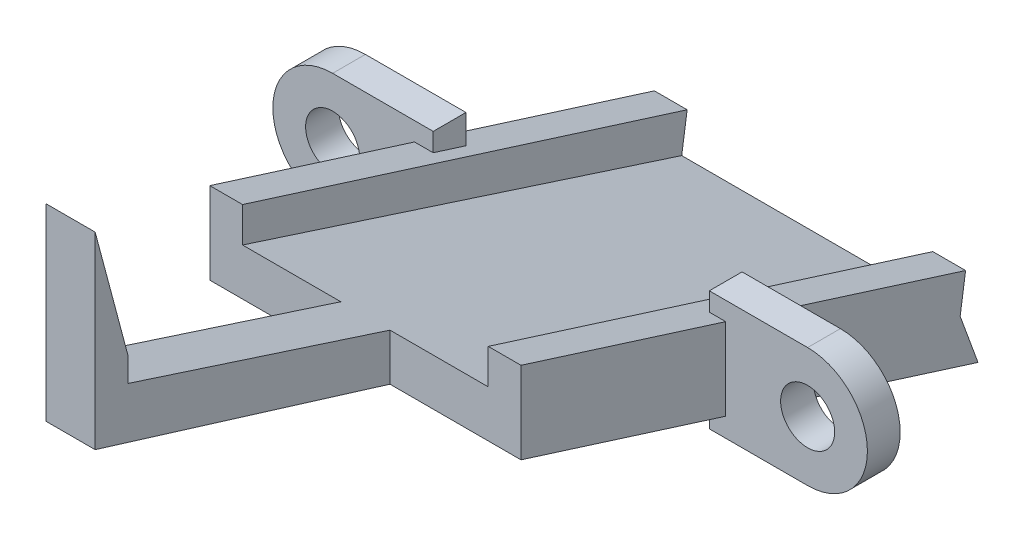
ISO-10303-21;
HEADER;
FILE_DESCRIPTION(('STEP AP214'),'2;1');
FILE_NAME('part.step','',(''),(''),'','','');
FILE_SCHEMA(('AUTOMOTIVE_DESIGN { 1 0 10303 214 1 1 1 1 }'));
ENDSEC;
DATA;
#1=APPLICATION_CONTEXT('core data for automotive mechanical design processes');
#2=APPLICATION_PROTOCOL_DEFINITION('international standard','automotive_design',2000,#1);
#3=PRODUCT_CONTEXT('',#1,'mechanical');
#4=PRODUCT('Part','Part','',(#3));
#5=PRODUCT_RELATED_PRODUCT_CATEGORY('part','',(#4));
#6=PRODUCT_DEFINITION_FORMATION('','',#4);
#7=PRODUCT_DEFINITION_CONTEXT('part definition',#1,'design');
#8=PRODUCT_DEFINITION('design','',#6,#7);
#9=PRODUCT_DEFINITION_SHAPE('','',#8);
#10=(LENGTH_UNIT() NAMED_UNIT(*) SI_UNIT(.MILLI.,.METRE.));
#11=(NAMED_UNIT(*) PLANE_ANGLE_UNIT() SI_UNIT($,.RADIAN.));
#12=(NAMED_UNIT(*) SI_UNIT($,.STERADIAN.) SOLID_ANGLE_UNIT());
#13=UNCERTAINTY_MEASURE_WITH_UNIT(LENGTH_MEASURE(1.E-05),#10,'distance_accuracy_value','');
#14=(GEOMETRIC_REPRESENTATION_CONTEXT(3) GLOBAL_UNCERTAINTY_ASSIGNED_CONTEXT((#13)) GLOBAL_UNIT_ASSIGNED_CONTEXT((#10,
#11,#12)) REPRESENTATION_CONTEXT('',''));
#15=CARTESIAN_POINT('',(0.,0.,0.));
#16=DIRECTION('',(0.,0.,1.));
#17=DIRECTION('',(1.,0.,0.));
#18=AXIS2_PLACEMENT_3D('',#15,#16,#17);
#19=CARTESIAN_POINT('',(9.5,-5.53846153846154,-18.));
#20=DIRECTION('',(0.,0.953696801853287,-0.300769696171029));
#21=DIRECTION('',(0.,0.300769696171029,0.953696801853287));
#22=AXIS2_PLACEMENT_3D('',#19,#20,#21);
#23=PLANE('',#22);
#24=DIRECTION('',(0.,-0.300769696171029,-0.953696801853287));
#25=VECTOR('',#24,1.);
#26=CARTESIAN_POINT('',(-9.5,-5.53846153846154,-18.));
#27=LINE('',#26,#25);
#28=CARTESIAN_POINT('',(-9.5,-5.53846153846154,-18.));
#29=VERTEX_POINT('',#28);
#30=CARTESIAN_POINT('',(-9.5,-9.48061715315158,-30.5));
#31=VERTEX_POINT('',#30);
#32=EDGE_CURVE('E453',#29,#31,#27,.T.);
#33=ORIENTED_EDGE('',*,*,#32,.T.);
#34=DIRECTION('',(1.,0.,0.));
#35=VECTOR('',#34,1.);
#36=CARTESIAN_POINT('',(9.5,-9.48061715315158,-30.5));
#37=LINE('',#36,#35);
#38=CARTESIAN_POINT('',(-8.36014397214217,-9.48061715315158,-30.5));
#39=VERTEX_POINT('',#38);
#40=EDGE_CURVE('E61',#31,#39,#37,.T.);
#41=ORIENTED_EDGE('',*,*,#40,.T.);
#42=DIRECTION('',(0.,0.300769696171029,0.953696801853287));
#43=VECTOR('',#42,1.);
#44=CARTESIAN_POINT('',(-8.36014397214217,-5.53846153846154,-18.));
#45=LINE('',#44,#43);
#46=CARTESIAN_POINT('',(-8.36014397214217,-10.111362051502,-32.5));
#47=VERTEX_POINT('',#46);
#48=EDGE_CURVE('E65',#47,#39,#45,.T.);
#49=ORIENTED_EDGE('',*,*,#48,.F.);
#50=DIRECTION('',(1.,0.,0.));
#51=VECTOR('',#50,1.);
#52=CARTESIAN_POINT('',(9.5,-10.111362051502,-32.5));
#53=LINE('',#52,#51);
#54=CARTESIAN_POINT('',(-9.5,-10.111362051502,-32.5));
#55=VERTEX_POINT('',#54);
#56=EDGE_CURVE('E344',#55,#47,#53,.T.);
#57=ORIENTED_EDGE('',*,*,#56,.F.);
#58=CARTESIAN_POINT('',(-9.5,-14.3379199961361,-45.9017982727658));
#59=VERTEX_POINT('',#58);
#60=EDGE_CURVE('E452',#55,#59,#27,.T.);
#61=ORIENTED_EDGE('',*,*,#60,.T.);
#62=DIRECTION('',(-1.,0.,0.));
#63=VECTOR('',#62,1.);
#64=CARTESIAN_POINT('',(1.5,-14.3379199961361,-45.9017982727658));
#65=LINE('',#64,#63);
#66=CARTESIAN_POINT('',(9.5,-14.3379199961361,-45.9017982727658));
#67=VERTEX_POINT('',#66);
#68=EDGE_CURVE('E525',#67,#59,#65,.T.);
#69=ORIENTED_EDGE('',*,*,#68,.F.);
#70=DIRECTION('',(0.,-0.300769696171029,-0.953696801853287));
#71=VECTOR('',#70,1.);
#72=CARTESIAN_POINT('',(9.5,-5.53846153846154,-18.));
#73=LINE('',#72,#71);
#74=CARTESIAN_POINT('',(9.5,-10.111362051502,-32.5));
#75=VERTEX_POINT('',#74);
#76=EDGE_CURVE('E438',#75,#67,#73,.T.);
#77=ORIENTED_EDGE('',*,*,#76,.F.);
#78=DIRECTION('',(-1.,0.,0.));
#79=VECTOR('',#78,1.);
#80=CARTESIAN_POINT('',(9.5,-10.111362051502,-32.5));
#81=LINE('',#80,#79);
#82=CARTESIAN_POINT('',(8.49870989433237,-10.111362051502,-32.5));
#83=VERTEX_POINT('',#82);
#84=EDGE_CURVE('E360',#75,#83,#81,.T.);
#85=ORIENTED_EDGE('',*,*,#84,.T.);
#86=DIRECTION('',(0.,-0.300769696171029,-0.953696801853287));
#87=VECTOR('',#86,1.);
#88=CARTESIAN_POINT('',(8.49870989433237,-5.53846153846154,-18.));
#89=LINE('',#88,#87);
#90=CARTESIAN_POINT('',(8.49870989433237,-9.48061715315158,-30.5));
#91=VERTEX_POINT('',#90);
#92=EDGE_CURVE('E352',#91,#83,#89,.T.);
#93=ORIENTED_EDGE('',*,*,#92,.F.);
#94=DIRECTION('',(-1.,0.,0.));
#95=VECTOR('',#94,1.);
#96=CARTESIAN_POINT('',(9.5,-9.48061715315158,-30.5));
#97=LINE('',#96,#95);
#98=CARTESIAN_POINT('',(9.5,-9.48061715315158,-30.5));
#99=VERTEX_POINT('',#98);
#100=EDGE_CURVE('E366',#99,#91,#97,.T.);
#101=ORIENTED_EDGE('',*,*,#100,.F.);
#102=CARTESIAN_POINT('',(9.5,-5.53846153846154,-18.));
#103=VERTEX_POINT('',#102);
#104=EDGE_CURVE('E440',#103,#99,#73,.T.);
#105=ORIENTED_EDGE('',*,*,#104,.F.);
#106=DIRECTION('',(-1.,0.,0.));
#107=VECTOR('',#106,1.);
#108=CARTESIAN_POINT('',(9.5,-5.53846153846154,-18.));
#109=LINE('',#108,#107);
#110=CARTESIAN_POINT('',(1.5,-5.53846153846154,-18.));
#111=VERTEX_POINT('',#110);
#112=EDGE_CURVE('E458',#103,#111,#109,.T.);
#113=ORIENTED_EDGE('',*,*,#112,.T.);
#114=CARTESIAN_POINT('',(-1.5,-5.53846153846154,-18.));
#115=VERTEX_POINT('',#114);
#116=EDGE_CURVE('E462',#111,#115,#109,.T.);
#117=ORIENTED_EDGE('',*,*,#116,.T.);
#118=EDGE_CURVE('E448',#115,#29,#109,.T.);
#119=ORIENTED_EDGE('',*,*,#118,.T.);
#120=EDGE_LOOP('',(#33,#41,#49,#57,#61,#69,#77,#85,#93,#101,#105,#113,#117,#119));
#121=FACE_BOUND('',#120,.T.);
#122=ADVANCED_FACE('F45',(#121),#23,.F.);
#123=CARTESIAN_POINT('',(9.5,0.,0.));
#124=DIRECTION('',(1.,0.,0.));
#125=DIRECTION('',(0.,0.,-1.));
#126=AXIS2_PLACEMENT_3D('',#123,#124,#125);
#127=PLANE('',#126);
#128=ORIENTED_EDGE('',*,*,#104,.T.);
#129=DIRECTION('',(0.,1.,0.));
#130=VECTOR('',#129,1.);
#131=CARTESIAN_POINT('',(9.5,0.,-30.5));
#132=LINE('',#131,#130);
#133=CARTESIAN_POINT('',(9.5,-4.48061715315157,-30.5));
#134=VERTEX_POINT('',#133);
#135=EDGE_CURVE('E363',#99,#134,#132,.T.);
#136=ORIENTED_EDGE('',*,*,#135,.T.);
#137=DIRECTION('',(0.,-0.300769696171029,-0.953696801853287));
#138=VECTOR('',#137,1.);
#139=CARTESIAN_POINT('',(9.5,4.67342474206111,-1.4738694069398));
#140=LINE('',#139,#138);
#141=CARTESIAN_POINT('',(9.5,-0.538461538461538,-18.));
#142=VERTEX_POINT('',#141);
#143=EDGE_CURVE('E417',#142,#134,#140,.T.);
#144=ORIENTED_EDGE('',*,*,#143,.F.);
#145=DIRECTION('',(0.,-1.,0.));
#146=VECTOR('',#145,1.);
#147=CARTESIAN_POINT('',(9.5,-2.67891095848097,-18.));
#148=LINE('',#147,#146);
#149=EDGE_CURVE('E435',#142,#103,#148,.T.);
#150=ORIENTED_EDGE('',*,*,#149,.T.);
#151=EDGE_LOOP('',(#128,#136,#144,#150));
#152=FACE_BOUND('',#151,.T.);
#153=ADVANCED_FACE('F670',(#152),#127,.T.);
#154=CARTESIAN_POINT('',(-9.5,0.,0.));
#155=DIRECTION('',(1.,0.,0.));
#156=DIRECTION('',(0.,0.,-1.));
#157=AXIS2_PLACEMENT_3D('',#154,#155,#156);
#158=PLANE('',#157);
#159=DIRECTION('',(0.,-1.,0.));
#160=VECTOR('',#159,1.);
#161=CARTESIAN_POINT('',(-9.5,0.,-32.5));
#162=LINE('',#161,#160);
#163=CARTESIAN_POINT('',(-9.5,-5.11136205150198,-32.5));
#164=VERTEX_POINT('',#163);
#165=EDGE_CURVE('E280',#164,#55,#162,.T.);
#166=ORIENTED_EDGE('',*,*,#165,.F.);
#167=DIRECTION('',(0.,0.300769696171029,0.953696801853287));
#168=VECTOR('',#167,1.);
#169=CARTESIAN_POINT('',(-9.5,4.67342474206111,-1.4738694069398));
#170=LINE('',#169,#168);
#171=CARTESIAN_POINT('',(-9.5,-9.09931594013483,-45.1452196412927));
#172=VERTEX_POINT('',#171);
#173=EDGE_CURVE('E384',#172,#164,#170,.T.);
#174=ORIENTED_EDGE('',*,*,#173,.F.);
#175=DIRECTION('',(0.,0.989359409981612,-0.145492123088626));
#176=VECTOR('',#175,1.);
#177=CARTESIAN_POINT('',(-9.5,-6.69099748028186,-45.4993794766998));
#178=LINE('',#177,#176);
#179=CARTESIAN_POINT('',(-9.5,-11.3578239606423,-44.8130904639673));
#180=VERTEX_POINT('',#179);
#181=EDGE_CURVE('E376',#180,#172,#178,.T.);
#182=ORIENTED_EDGE('',*,*,#181,.F.);
#183=DIRECTION('',(0.,0.939282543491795,0.343144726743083));
#184=VECTOR('',#183,1.);
#185=CARTESIAN_POINT('',(-9.5,-14.3379199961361,-45.9017982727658));
#186=LINE('',#185,#184);
#187=EDGE_CURVE('E439',#59,#180,#186,.T.);
#188=ORIENTED_EDGE('',*,*,#187,.F.);
#189=ORIENTED_EDGE('',*,*,#60,.F.);
#190=EDGE_LOOP('',(#166,#174,#182,#188,#189));
#191=FACE_BOUND('',#190,.T.);
#192=ADVANCED_FACE('F656',(#191),#158,.F.);
#193=CARTESIAN_POINT('',(7.5,4.67342474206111,-1.4738694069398));
#194=DIRECTION('',(0.,-0.953696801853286,0.300769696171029));
#195=DIRECTION('',(0.,-0.300769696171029,-0.953696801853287));
#196=AXIS2_PLACEMENT_3D('',#193,#194,#195);
#197=PLANE('',#196);
#198=DIRECTION('',(1.,0.,0.));
#199=VECTOR('',#198,1.);
#200=CARTESIAN_POINT('',(7.5,-4.48061715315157,-30.5));
#201=LINE('',#200,#199);
#202=CARTESIAN_POINT('',(8.49870989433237,-4.48061715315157,-30.5));
#203=VERTEX_POINT('',#202);
#204=EDGE_CURVE('E11',#203,#134,#201,.T.);
#205=ORIENTED_EDGE('',*,*,#204,.F.);
#206=DIRECTION('',(0.,0.300769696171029,0.953696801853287));
#207=VECTOR('',#206,1.);
#208=CARTESIAN_POINT('',(8.49870989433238,4.67342474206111,-1.4738694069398));
#209=LINE('',#208,#207);
#210=CARTESIAN_POINT('',(8.49870989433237,-5.11136205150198,-32.5));
#211=VERTEX_POINT('',#210);
#212=EDGE_CURVE('E544',#211,#203,#209,.T.);
#213=ORIENTED_EDGE('',*,*,#212,.F.);
#214=DIRECTION('',(1.,0.,0.));
#215=VECTOR('',#214,1.);
#216=CARTESIAN_POINT('',(7.5,-5.11136205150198,-32.5));
#217=LINE('',#216,#215);
#218=CARTESIAN_POINT('',(9.5,-5.11136205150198,-32.5));
#219=VERTEX_POINT('',#218);
#220=EDGE_CURVE('E54',#211,#219,#217,.T.);
#221=ORIENTED_EDGE('',*,*,#220,.T.);
#222=CARTESIAN_POINT('',(9.5,-9.09931594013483,-45.1452196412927));
#223=VERTEX_POINT('',#222);
#224=EDGE_CURVE('E405',#219,#223,#140,.T.);
#225=ORIENTED_EDGE('',*,*,#224,.T.);
#226=DIRECTION('',(1.,0.,0.));
#227=VECTOR('',#226,1.);
#228=CARTESIAN_POINT('',(7.5,-9.09931594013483,-45.1452196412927));
#229=LINE('',#228,#227);
#230=CARTESIAN_POINT('',(7.5,-9.09931594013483,-45.1452196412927));
#231=VERTEX_POINT('',#230);
#232=EDGE_CURVE('E416',#231,#223,#229,.T.);
#233=ORIENTED_EDGE('',*,*,#232,.F.);
#234=DIRECTION('',(0.,-0.300769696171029,-0.953696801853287));
#235=VECTOR('',#234,1.);
#236=CARTESIAN_POINT('',(7.5,4.67342474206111,-1.4738694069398));
#237=LINE('',#236,#235);
#238=CARTESIAN_POINT('',(7.5,-0.538461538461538,-18.));
#239=VERTEX_POINT('',#238);
#240=EDGE_CURVE('E409',#239,#231,#237,.T.);
#241=ORIENTED_EDGE('',*,*,#240,.F.);
#242=DIRECTION('',(1.,0.,0.));
#243=VECTOR('',#242,1.);
#244=CARTESIAN_POINT('',(7.5,-0.538461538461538,-18.));
#245=LINE('',#244,#243);
#246=EDGE_CURVE('E426',#239,#142,#245,.T.);
#247=ORIENTED_EDGE('',*,*,#246,.T.);
#248=ORIENTED_EDGE('',*,*,#143,.T.);
#249=EDGE_LOOP('',(#205,#213,#221,#225,#233,#241,#247,#248));
#250=FACE_BOUND('',#249,.T.);
#251=ADVANCED_FACE('F551',(#250),#197,.F.);
#252=CARTESIAN_POINT('',(1.5,2.5,-2.));
#253=DIRECTION('',(0.,-0.951402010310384,0.30795164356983));
#254=DIRECTION('',(0.,-0.30795164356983,-0.951402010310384));
#255=AXIS2_PLACEMENT_3D('',#252,#253,#254);
#256=PLANE('',#255);
#257=DIRECTION('',(0.,-0.30795164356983,-0.951402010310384));
#258=VECTOR('',#257,1.);
#259=CARTESIAN_POINT('',(-7.5,2.5,-2.));
#260=LINE('',#259,#258);
#261=CARTESIAN_POINT('',(-7.5,-2.67891095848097,-18.));
#262=VERTEX_POINT('',#261);
#263=CARTESIAN_POINT('',(-7.5,-11.3578239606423,-44.8130904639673));
#264=VERTEX_POINT('',#263);
#265=EDGE_CURVE('E401',#262,#264,#260,.T.);
#266=ORIENTED_EDGE('',*,*,#265,.F.);
#267=DIRECTION('',(-1.,0.,0.));
#268=VECTOR('',#267,1.);
#269=CARTESIAN_POINT('',(9.5,-2.67891095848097,-18.));
#270=LINE('',#269,#268);
#271=CARTESIAN_POINT('',(-1.5,-2.67891095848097,-18.));
#272=VERTEX_POINT('',#271);
#273=EDGE_CURVE('E461',#272,#262,#270,.T.);
#274=ORIENTED_EDGE('',*,*,#273,.F.);
#275=DIRECTION('',(0.,0.30795164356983,0.951402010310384));
#276=VECTOR('',#275,1.);
#277=CARTESIAN_POINT('',(-1.5,2.5,-2.));
#278=LINE('',#277,#276);
#279=CARTESIAN_POINT('',(-1.5,2.5,-2.));
#280=VERTEX_POINT('',#279);
#281=EDGE_CURVE('E492',#272,#280,#278,.T.);
#282=ORIENTED_EDGE('',*,*,#281,.T.);
#283=DIRECTION('',(-1.,0.,0.));
#284=VECTOR('',#283,1.);
#285=CARTESIAN_POINT('',(1.5,2.5,-2.));
#286=LINE('',#285,#284);
#287=CARTESIAN_POINT('',(1.5,2.5,-2.));
#288=VERTEX_POINT('',#287);
#289=EDGE_CURVE('E516',#288,#280,#286,.T.);
#290=ORIENTED_EDGE('',*,*,#289,.F.);
#291=DIRECTION('',(0.,0.30795164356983,0.951402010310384));
#292=VECTOR('',#291,1.);
#293=CARTESIAN_POINT('',(1.5,2.5,-2.));
#294=LINE('',#293,#292);
#295=CARTESIAN_POINT('',(1.5,-2.67891095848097,-18.));
#296=VERTEX_POINT('',#295);
#297=EDGE_CURVE('E475',#296,#288,#294,.T.);
#298=ORIENTED_EDGE('',*,*,#297,.F.);
#299=CARTESIAN_POINT('',(7.5,-2.67891095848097,-18.));
#300=VERTEX_POINT('',#299);
#301=EDGE_CURVE('E463',#300,#296,#270,.T.);
#302=ORIENTED_EDGE('',*,*,#301,.F.);
#303=DIRECTION('',(0.,-0.30795164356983,-0.951402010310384));
#304=VECTOR('',#303,1.);
#305=CARTESIAN_POINT('',(7.5,2.5,-2.));
#306=LINE('',#305,#304);
#307=CARTESIAN_POINT('',(7.5,-11.3578239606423,-44.8130904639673));
#308=VERTEX_POINT('',#307);
#309=EDGE_CURVE('E430',#300,#308,#306,.T.);
#310=ORIENTED_EDGE('',*,*,#309,.T.);
#311=DIRECTION('',(-1.,0.,0.));
#312=VECTOR('',#311,1.);
#313=CARTESIAN_POINT('',(1.5,-11.3578239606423,-44.8130904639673));
#314=LINE('',#313,#312);
#315=EDGE_CURVE('E520',#308,#264,#314,.T.);
#316=ORIENTED_EDGE('',*,*,#315,.T.);
#317=EDGE_LOOP('',(#266,#274,#282,#290,#298,#302,#310,#316));
#318=FACE_BOUND('',#317,.T.);
#319=ADVANCED_FACE('F642',(#318),#256,.F.);
#320=CARTESIAN_POINT('',(1.5,0.,0.));
#321=DIRECTION('',(0.,0.95577900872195,-0.294085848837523));
#322=DIRECTION('',(0.,0.294085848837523,0.95577900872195));
#323=AXIS2_PLACEMENT_3D('',#320,#321,#322);
#324=PLANE('',#323);
#325=ORIENTED_EDGE('',*,*,#116,.F.);
#326=DIRECTION('',(0.,-0.294085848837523,-0.95577900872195));
#327=VECTOR('',#326,1.);
#328=CARTESIAN_POINT('',(1.5,0.,0.));
#329=LINE('',#328,#327);
#330=CARTESIAN_POINT('',(1.5,0.,0.));
#331=VERTEX_POINT('',#330);
#332=EDGE_CURVE('E471',#331,#111,#329,.T.);
#333=ORIENTED_EDGE('',*,*,#332,.F.);
#334=DIRECTION('',(-1.,0.,0.));
#335=VECTOR('',#334,1.);
#336=CARTESIAN_POINT('',(1.5,0.,0.));
#337=LINE('',#336,#335);
#338=CARTESIAN_POINT('',(-1.5,0.,0.));
#339=VERTEX_POINT('',#338);
#340=EDGE_CURVE('E488',#331,#339,#337,.T.);
#341=ORIENTED_EDGE('',*,*,#340,.T.);
#342=DIRECTION('',(0.,-0.294085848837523,-0.95577900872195));
#343=VECTOR('',#342,1.);
#344=CARTESIAN_POINT('',(-1.5,0.,0.));
#345=LINE('',#344,#343);
#346=EDGE_CURVE('E470',#339,#115,#345,.T.);
#347=ORIENTED_EDGE('',*,*,#346,.T.);
#348=EDGE_LOOP('',(#325,#333,#341,#347));
#349=FACE_BOUND('',#348,.T.);
#350=ADVANCED_FACE('F47',(#349),#324,.F.);
#351=CARTESIAN_POINT('',(1.5,0.,0.));
#352=DIRECTION('',(-1.,0.,0.));
#353=DIRECTION('',(0.,0.,1.));
#354=AXIS2_PLACEMENT_3D('',#351,#352,#353);
#355=PLANE('',#354);
#356=DIRECTION('',(0.,-1.,0.));
#357=VECTOR('',#356,1.);
#358=CARTESIAN_POINT('',(1.5,0.,-18.));
#359=LINE('',#358,#357);
#360=EDGE_CURVE('E466',#296,#111,#359,.T.);
#361=ORIENTED_EDGE('',*,*,#360,.F.);
#362=ORIENTED_EDGE('',*,*,#297,.T.);
#363=DIRECTION('',(0.,1.,0.));
#364=VECTOR('',#363,1.);
#365=CARTESIAN_POINT('',(1.5,4.,-2.));
#366=LINE('',#365,#364);
#367=CARTESIAN_POINT('',(1.5,4.,-2.));
#368=VERTEX_POINT('',#367);
#369=EDGE_CURVE('E479',#288,#368,#366,.T.);
#370=ORIENTED_EDGE('',*,*,#369,.T.);
#371=DIRECTION('',(0.,0.966283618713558,0.257480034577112));
#372=VECTOR('',#371,1.);
#373=CARTESIAN_POINT('',(1.5,10.6732313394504,-0.221822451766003));
#374=LINE('',#373,#372);
#375=CARTESIAN_POINT('',(1.5,11.5056974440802,0.));
#376=VERTEX_POINT('',#375);
#377=EDGE_CURVE('E482',#368,#376,#374,.T.);
#378=ORIENTED_EDGE('',*,*,#377,.T.);
#379=DIRECTION('',(0.,-1.,0.));
#380=VECTOR('',#379,1.);
#381=CARTESIAN_POINT('',(1.5,11.5056974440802,0.));
#382=LINE('',#381,#380);
#383=EDGE_CURVE('E485',#376,#331,#382,.T.);
#384=ORIENTED_EDGE('',*,*,#383,.T.);
#385=ORIENTED_EDGE('',*,*,#332,.T.);
#386=EDGE_LOOP('',(#361,#362,#370,#378,#384,#385));
#387=FACE_BOUND('',#386,.T.);
#388=ADVANCED_FACE('F683',(#387),#355,.F.);
#389=CARTESIAN_POINT('',(-1.5,0.,0.));
#390=DIRECTION('',(-1.,0.,0.));
#391=DIRECTION('',(0.,0.,1.));
#392=AXIS2_PLACEMENT_3D('',#389,#390,#391);
#393=PLANE('',#392);
#394=ORIENTED_EDGE('',*,*,#281,.F.);
#395=DIRECTION('',(0.,-1.,0.));
#396=VECTOR('',#395,1.);
#397=CARTESIAN_POINT('',(-1.5,0.,-18.));
#398=LINE('',#397,#396);
#399=EDGE_CURVE('E529',#272,#115,#398,.T.);
#400=ORIENTED_EDGE('',*,*,#399,.T.);
#401=ORIENTED_EDGE('',*,*,#346,.F.);
#402=DIRECTION('',(0.,-1.,0.));
#403=VECTOR('',#402,1.);
#404=CARTESIAN_POINT('',(-1.5,0.,0.));
#405=LINE('',#404,#403);
#406=CARTESIAN_POINT('',(-1.5,11.5056974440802,0.));
#407=VERTEX_POINT('',#406);
#408=EDGE_CURVE('E476',#407,#339,#405,.T.);
#409=ORIENTED_EDGE('',*,*,#408,.F.);
#410=DIRECTION('',(0.,0.966283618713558,0.257480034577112));
#411=VECTOR('',#410,1.);
#412=CARTESIAN_POINT('',(-1.5,10.6732313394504,-0.221822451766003));
#413=LINE('',#412,#411);
#414=CARTESIAN_POINT('',(-1.5,4.,-2.));
#415=VERTEX_POINT('',#414);
#416=EDGE_CURVE('E499',#415,#407,#413,.T.);
#417=ORIENTED_EDGE('',*,*,#416,.F.);
#418=DIRECTION('',(0.,1.,0.));
#419=VECTOR('',#418,1.);
#420=CARTESIAN_POINT('',(-1.5,4.,-2.));
#421=LINE('',#420,#419);
#422=EDGE_CURVE('E495',#280,#415,#421,.T.);
#423=ORIENTED_EDGE('',*,*,#422,.F.);
#424=EDGE_LOOP('',(#394,#400,#401,#409,#417,#423));
#425=FACE_BOUND('',#424,.T.);
#426=ADVANCED_FACE('F686',(#425),#393,.T.);
#427=CARTESIAN_POINT('',(1.5,-11.3578239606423,-44.8130904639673));
#428=DIRECTION('',(0.,-0.343144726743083,0.939282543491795));
#429=DIRECTION('',(0.,-0.939282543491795,-0.343144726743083));
#430=AXIS2_PLACEMENT_3D('',#427,#428,#429);
#431=PLANE('',#430);
#432=DIRECTION('',(-1.,0.,0.));
#433=VECTOR('',#432,1.);
#434=CARTESIAN_POINT('',(-7.5,-11.3578239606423,-44.8130904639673));
#435=LINE('',#434,#433);
#436=EDGE_CURVE('E393',#264,#180,#435,.T.);
#437=ORIENTED_EDGE('',*,*,#436,.F.);
#438=ORIENTED_EDGE('',*,*,#315,.F.);
#439=CARTESIAN_POINT('',(9.5,-11.3578239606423,-44.8130904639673));
#440=VERTEX_POINT('',#439);
#441=EDGE_CURVE('E521',#440,#308,#314,.T.);
#442=ORIENTED_EDGE('',*,*,#441,.F.);
#443=DIRECTION('',(0.,0.939282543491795,0.343144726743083));
#444=VECTOR('',#443,1.);
#445=CARTESIAN_POINT('',(9.5,-14.3379199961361,-45.9017982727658));
#446=LINE('',#445,#444);
#447=EDGE_CURVE('E444',#67,#440,#446,.T.);
#448=ORIENTED_EDGE('',*,*,#447,.F.);
#449=ORIENTED_EDGE('',*,*,#68,.T.);
#450=ORIENTED_EDGE('',*,*,#187,.T.);
#451=EDGE_LOOP('',(#437,#438,#442,#448,#449,#450));
#452=FACE_BOUND('',#451,.T.);
#453=ADVANCED_FACE('F690',(#452),#431,.F.);
#454=CARTESIAN_POINT('',(1.5,4.,-2.));
#455=DIRECTION('',(0.,0.,1.));
#456=DIRECTION('',(0.,-1.,0.));
#457=AXIS2_PLACEMENT_3D('',#454,#455,#456);
#458=PLANE('',#457);
#459=ORIENTED_EDGE('',*,*,#422,.T.);
#460=DIRECTION('',(-1.,0.,0.));
#461=VECTOR('',#460,1.);
#462=CARTESIAN_POINT('',(1.5,4.,-2.));
#463=LINE('',#462,#461);
#464=EDGE_CURVE('E512',#368,#415,#463,.T.);
#465=ORIENTED_EDGE('',*,*,#464,.F.);
#466=ORIENTED_EDGE('',*,*,#369,.F.);
#467=ORIENTED_EDGE('',*,*,#289,.T.);
#468=EDGE_LOOP('',(#459,#465,#466,#467));
#469=FACE_BOUND('',#468,.T.);
#470=ADVANCED_FACE('F699',(#469),#458,.F.);
#471=CARTESIAN_POINT('',(1.5,10.6732313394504,-0.221822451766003));
#472=DIRECTION('',(0.,-0.257480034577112,0.966283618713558));
#473=DIRECTION('',(0.,-0.966283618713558,-0.257480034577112));
#474=AXIS2_PLACEMENT_3D('',#471,#472,#473);
#475=PLANE('',#474);
#476=ORIENTED_EDGE('',*,*,#416,.T.);
#477=DIRECTION('',(-1.,0.,0.));
#478=VECTOR('',#477,1.);
#479=CARTESIAN_POINT('',(1.5,11.5056974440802,0.));
#480=LINE('',#479,#478);
#481=EDGE_CURVE('E508',#376,#407,#480,.T.);
#482=ORIENTED_EDGE('',*,*,#481,.F.);
#483=ORIENTED_EDGE('',*,*,#377,.F.);
#484=ORIENTED_EDGE('',*,*,#464,.T.);
#485=EDGE_LOOP('',(#476,#482,#483,#484));
#486=FACE_BOUND('',#485,.T.);
#487=ADVANCED_FACE('F695',(#486),#475,.F.);
#488=CARTESIAN_POINT('',(1.5,0.,0.));
#489=DIRECTION('',(0.,0.,-1.));
#490=DIRECTION('',(-1.,0.,0.));
#491=AXIS2_PLACEMENT_3D('',#488,#489,#490);
#492=PLANE('',#491);
#493=ORIENTED_EDGE('',*,*,#408,.T.);
#494=ORIENTED_EDGE('',*,*,#340,.F.);
#495=ORIENTED_EDGE('',*,*,#383,.F.);
#496=ORIENTED_EDGE('',*,*,#481,.T.);
#497=EDGE_LOOP('',(#493,#494,#495,#496));
#498=FACE_BOUND('',#497,.T.);
#499=ADVANCED_FACE('F692',(#498),#492,.F.);
#500=CARTESIAN_POINT('',(9.5,-2.67891095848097,-18.));
#501=DIRECTION('',(0.,0.,-1.));
#502=DIRECTION('',(-1.,0.,0.));
#503=AXIS2_PLACEMENT_3D('',#500,#501,#502);
#504=PLANE('',#503);
#505=ORIENTED_EDGE('',*,*,#360,.T.);
#506=ORIENTED_EDGE('',*,*,#112,.F.);
#507=ORIENTED_EDGE('',*,*,#149,.F.);
#508=ORIENTED_EDGE('',*,*,#246,.F.);
#509=DIRECTION('',(0.,1.,0.));
#510=VECTOR('',#509,1.);
#511=CARTESIAN_POINT('',(7.5,0.,-18.));
#512=LINE('',#511,#510);
#513=EDGE_CURVE('E406',#300,#239,#512,.T.);
#514=ORIENTED_EDGE('',*,*,#513,.F.);
#515=ORIENTED_EDGE('',*,*,#301,.T.);
#516=EDGE_LOOP('',(#505,#506,#507,#508,#514,#515));
#517=FACE_BOUND('',#516,.T.);
#518=ADVANCED_FACE('F682',(#517),#504,.F.);
#519=DIRECTION('',(0.,-1.,0.));
#520=VECTOR('',#519,1.);
#521=CARTESIAN_POINT('',(-9.5,-2.67891095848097,-18.));
#522=LINE('',#521,#520);
#523=CARTESIAN_POINT('',(-9.5,-0.538461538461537,-18.));
#524=VERTEX_POINT('',#523);
#525=EDGE_CURVE('E434',#524,#29,#522,.T.);
#526=ORIENTED_EDGE('',*,*,#525,.T.);
#527=ORIENTED_EDGE('',*,*,#118,.F.);
#528=ORIENTED_EDGE('',*,*,#399,.F.);
#529=ORIENTED_EDGE('',*,*,#273,.T.);
#530=DIRECTION('',(0.,-1.,0.));
#531=VECTOR('',#530,1.);
#532=CARTESIAN_POINT('',(-7.5,0.,-18.));
#533=LINE('',#532,#531);
#534=CARTESIAN_POINT('',(-7.5,-0.538461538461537,-18.));
#535=VERTEX_POINT('',#534);
#536=EDGE_CURVE('E375',#535,#262,#533,.T.);
#537=ORIENTED_EDGE('',*,*,#536,.F.);
#538=DIRECTION('',(-1.,0.,0.));
#539=VECTOR('',#538,1.);
#540=CARTESIAN_POINT('',(-7.5,-0.538461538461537,-18.));
#541=LINE('',#540,#539);
#542=EDGE_CURVE('E397',#535,#524,#541,.T.);
#543=ORIENTED_EDGE('',*,*,#542,.T.);
#544=EDGE_LOOP('',(#526,#527,#528,#529,#537,#543));
#545=FACE_BOUND('',#544,.T.);
#546=ADVANCED_FACE('F627',(#545),#504,.F.);
#547=DIRECTION('',(0.,1.,0.));
#548=VECTOR('',#547,1.);
#549=CARTESIAN_POINT('',(9.5,0.,-32.5));
#550=LINE('',#549,#548);
#551=EDGE_CURVE('E356',#75,#219,#550,.T.);
#552=ORIENTED_EDGE('',*,*,#551,.F.);
#553=ORIENTED_EDGE('',*,*,#76,.T.);
#554=ORIENTED_EDGE('',*,*,#447,.T.);
#555=DIRECTION('',(0.,-0.989359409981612,0.145492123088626));
#556=VECTOR('',#555,1.);
#557=CARTESIAN_POINT('',(9.5,-6.69099748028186,-45.4993794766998));
#558=LINE('',#557,#556);
#559=EDGE_CURVE('E410',#223,#440,#558,.T.);
#560=ORIENTED_EDGE('',*,*,#559,.F.);
#561=ORIENTED_EDGE('',*,*,#224,.F.);
#562=EDGE_LOOP('',(#552,#553,#554,#560,#561));
#563=FACE_BOUND('',#562,.T.);
#564=ADVANCED_FACE('F557',(#563),#127,.T.);
#565=CARTESIAN_POINT('',(-9.5,-4.48061715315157,-30.5));
#566=VERTEX_POINT('',#565);
#567=EDGE_CURVE('E370',#566,#524,#170,.T.);
#568=ORIENTED_EDGE('',*,*,#567,.F.);
#569=DIRECTION('',(0.,-1.,0.));
#570=VECTOR('',#569,1.);
#571=CARTESIAN_POINT('',(-9.5,0.,-30.5));
#572=LINE('',#571,#570);
#573=EDGE_CURVE('E347',#566,#31,#572,.T.);
#574=ORIENTED_EDGE('',*,*,#573,.T.);
#575=ORIENTED_EDGE('',*,*,#32,.F.);
#576=ORIENTED_EDGE('',*,*,#525,.F.);
#577=EDGE_LOOP('',(#568,#574,#575,#576));
#578=FACE_BOUND('',#577,.T.);
#579=ADVANCED_FACE('F621',(#578),#158,.F.);
#580=CARTESIAN_POINT('',(7.5,0.,0.));
#581=DIRECTION('',(-1.,0.,0.));
#582=DIRECTION('',(0.,0.,1.));
#583=AXIS2_PLACEMENT_3D('',#580,#581,#582);
#584=PLANE('',#583);
#585=ORIENTED_EDGE('',*,*,#309,.F.);
#586=ORIENTED_EDGE('',*,*,#513,.T.);
#587=ORIENTED_EDGE('',*,*,#240,.T.);
#588=DIRECTION('',(0.,-0.989359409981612,0.145492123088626));
#589=VECTOR('',#588,1.);
#590=CARTESIAN_POINT('',(7.5,-6.69099748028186,-45.4993794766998));
#591=LINE('',#590,#589);
#592=EDGE_CURVE('E413',#231,#308,#591,.T.);
#593=ORIENTED_EDGE('',*,*,#592,.T.);
#594=EDGE_LOOP('',(#585,#586,#587,#593));
#595=FACE_BOUND('',#594,.T.);
#596=ADVANCED_FACE('F716',(#595),#584,.T.);
#597=CARTESIAN_POINT('',(7.5,-6.69099748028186,-45.4993794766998));
#598=DIRECTION('',(0.,0.145492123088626,0.989359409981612));
#599=DIRECTION('',(0.,-0.989359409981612,0.145492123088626));
#600=AXIS2_PLACEMENT_3D('',#597,#598,#599);
#601=PLANE('',#600);
#602=ORIENTED_EDGE('',*,*,#559,.T.);
#603=ORIENTED_EDGE('',*,*,#441,.T.);
#604=ORIENTED_EDGE('',*,*,#592,.F.);
#605=ORIENTED_EDGE('',*,*,#232,.T.);
#606=EDGE_LOOP('',(#602,#603,#604,#605));
#607=FACE_BOUND('',#606,.T.);
#608=ADVANCED_FACE('F711',(#607),#601,.F.);
#609=CARTESIAN_POINT('',(-7.5,0.,0.));
#610=DIRECTION('',(-1.,0.,0.));
#611=DIRECTION('',(0.,0.,1.));
#612=AXIS2_PLACEMENT_3D('',#609,#610,#611);
#613=PLANE('',#612);
#614=ORIENTED_EDGE('',*,*,#536,.T.);
#615=ORIENTED_EDGE('',*,*,#265,.T.);
#616=DIRECTION('',(0.,0.989359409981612,-0.145492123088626));
#617=VECTOR('',#616,1.);
#618=CARTESIAN_POINT('',(-7.5,-6.69099748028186,-45.4993794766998));
#619=LINE('',#618,#617);
#620=CARTESIAN_POINT('',(-7.5,-9.09931594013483,-45.1452196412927));
#621=VERTEX_POINT('',#620);
#622=EDGE_CURVE('E380',#264,#621,#619,.T.);
#623=ORIENTED_EDGE('',*,*,#622,.T.);
#624=DIRECTION('',(0.,0.300769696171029,0.953696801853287));
#625=VECTOR('',#624,1.);
#626=CARTESIAN_POINT('',(-7.5,4.67342474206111,-1.4738694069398));
#627=LINE('',#626,#625);
#628=EDGE_CURVE('E371',#621,#535,#627,.T.);
#629=ORIENTED_EDGE('',*,*,#628,.T.);
#630=EDGE_LOOP('',(#614,#615,#623,#629));
#631=FACE_BOUND('',#630,.T.);
#632=ADVANCED_FACE('F649',(#631),#613,.F.);
#633=CARTESIAN_POINT('',(-7.5,4.67342474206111,-1.4738694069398));
#634=DIRECTION('',(0.,-0.953696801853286,0.300769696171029));
#635=DIRECTION('',(0.,-0.300769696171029,-0.953696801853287));
#636=AXIS2_PLACEMENT_3D('',#633,#634,#635);
#637=PLANE('',#636);
#638=DIRECTION('',(0.,-0.300769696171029,-0.953696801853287));
#639=VECTOR('',#638,1.);
#640=CARTESIAN_POINT('',(-8.36014397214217,4.67342474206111,-1.4738694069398));
#641=LINE('',#640,#639);
#642=CARTESIAN_POINT('',(-8.36014397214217,-4.48061715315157,-30.5));
#643=VERTEX_POINT('',#642);
#644=CARTESIAN_POINT('',(-8.36014397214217,-5.11136205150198,-32.5));
#645=VERTEX_POINT('',#644);
#646=EDGE_CURVE('E533',#643,#645,#641,.T.);
#647=ORIENTED_EDGE('',*,*,#646,.F.);
#648=DIRECTION('',(-1.,0.,0.));
#649=VECTOR('',#648,1.);
#650=CARTESIAN_POINT('',(-7.5,-4.48061715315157,-30.5));
#651=LINE('',#650,#649);
#652=EDGE_CURVE('E541',#643,#566,#651,.T.);
#653=ORIENTED_EDGE('',*,*,#652,.T.);
#654=ORIENTED_EDGE('',*,*,#567,.T.);
#655=ORIENTED_EDGE('',*,*,#542,.F.);
#656=ORIENTED_EDGE('',*,*,#628,.F.);
#657=DIRECTION('',(-1.,0.,0.));
#658=VECTOR('',#657,1.);
#659=CARTESIAN_POINT('',(-7.5,-9.09931594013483,-45.1452196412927));
#660=LINE('',#659,#658);
#661=EDGE_CURVE('E383',#621,#172,#660,.T.);
#662=ORIENTED_EDGE('',*,*,#661,.T.);
#663=ORIENTED_EDGE('',*,*,#173,.T.);
#664=DIRECTION('',(-1.,0.,0.));
#665=VECTOR('',#664,1.);
#666=CARTESIAN_POINT('',(-7.5,-5.11136205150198,-32.5));
#667=LINE('',#666,#665);
#668=EDGE_CURVE('E537',#645,#164,#667,.T.);
#669=ORIENTED_EDGE('',*,*,#668,.F.);
#670=EDGE_LOOP('',(#647,#653,#654,#655,#656,#662,#663,#669));
#671=FACE_BOUND('',#670,.T.);
#672=ADVANCED_FACE('F632',(#671),#637,.F.);
#673=CARTESIAN_POINT('',(-7.5,-6.69099748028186,-45.4993794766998));
#674=DIRECTION('',(0.,0.145492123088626,0.989359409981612));
#675=DIRECTION('',(0.,-0.989359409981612,0.145492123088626));
#676=AXIS2_PLACEMENT_3D('',#673,#674,#675);
#677=PLANE('',#676);
#678=ORIENTED_EDGE('',*,*,#181,.T.);
#679=ORIENTED_EDGE('',*,*,#661,.F.);
#680=ORIENTED_EDGE('',*,*,#622,.F.);
#681=ORIENTED_EDGE('',*,*,#436,.T.);
#682=EDGE_LOOP('',(#678,#679,#680,#681));
#683=FACE_BOUND('',#682,.T.);
#684=ADVANCED_FACE('F652',(#683),#677,.F.);
#685=CARTESIAN_POINT('',(-14.5,-7.,-30.5));
#686=DIRECTION('',(0.,0.,1.));
#687=DIRECTION('',(1.,0.,0.));
#688=AXIS2_PLACEMENT_3D('',#685,#686,#687);
#689=PLANE('',#688);
#690=CARTESIAN_POINT('',(-14.5,-7.,-30.5));
#691=DIRECTION('',(0.,0.,1.));
#692=DIRECTION('',(1.,0.,0.));
#693=AXIS2_PLACEMENT_3D('',#690,#691,#692);
#694=CIRCLE('',#693,1.65);
#695=CARTESIAN_POINT('',(-12.85,-7.,-30.5));
#696=VERTEX_POINT('',#695);
#697=EDGE_CURVE('E576',#696,#696,#694,.T.);
#698=ORIENTED_EDGE('',*,*,#697,.F.);
#699=EDGE_LOOP('',(#698));
#700=FACE_BOUND('',#699,.T.);
#701=ORIENTED_EDGE('',*,*,#40,.F.);
#702=ORIENTED_EDGE('',*,*,#573,.F.);
#703=ORIENTED_EDGE('',*,*,#652,.F.);
#704=DIRECTION('',(0.,1.,0.));
#705=VECTOR('',#704,1.);
#706=CARTESIAN_POINT('',(-8.36014397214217,-3.35,-30.5));
#707=LINE('',#706,#705);
#708=CARTESIAN_POINT('',(-8.36014397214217,-3.35,-30.5));
#709=VERTEX_POINT('',#708);
#710=EDGE_CURVE('E260',#643,#709,#707,.T.);
#711=ORIENTED_EDGE('',*,*,#710,.T.);
#712=DIRECTION('',(-1.,0.,0.));
#713=VECTOR('',#712,1.);
#714=CARTESIAN_POINT('',(-14.5,-3.35,-30.5));
#715=LINE('',#714,#713);
#716=CARTESIAN_POINT('',(-14.5,-3.35,-30.5));
#717=VERTEX_POINT('',#716);
#718=EDGE_CURVE('E266',#709,#717,#715,.T.);
#719=ORIENTED_EDGE('',*,*,#718,.T.);
#720=CARTESIAN_POINT('',(-14.5,-7.,-30.5));
#721=DIRECTION('',(0.,0.,1.));
#722=DIRECTION('',(1.,0.,0.));
#723=AXIS2_PLACEMENT_3D('',#720,#721,#722);
#724=CIRCLE('',#723,3.65);
#725=CARTESIAN_POINT('',(-14.5,-10.65,-30.5));
#726=VERTEX_POINT('',#725);
#727=EDGE_CURVE('E261',#717,#726,#724,.T.);
#728=ORIENTED_EDGE('',*,*,#727,.T.);
#729=DIRECTION('',(1.,0.,0.));
#730=VECTOR('',#729,1.);
#731=CARTESIAN_POINT('',(-14.5,-10.65,-30.5));
#732=LINE('',#731,#730);
#733=CARTESIAN_POINT('',(-8.36014397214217,-10.65,-30.5));
#734=VERTEX_POINT('',#733);
#735=EDGE_CURVE('E248',#726,#734,#732,.T.);
#736=ORIENTED_EDGE('',*,*,#735,.T.);
#737=EDGE_CURVE('E595',#734,#39,#707,.T.);
#738=ORIENTED_EDGE('',*,*,#737,.T.);
#739=EDGE_LOOP('',(#701,#702,#703,#711,#719,#728,#736,#738));
#740=FACE_BOUND('',#739,.T.);
#741=ADVANCED_FACE('F264',(#700,#740),#689,.T.);
#742=CARTESIAN_POINT('',(-14.5,-7.,-32.5));
#743=DIRECTION('',(0.,0.,1.));
#744=DIRECTION('',(1.,0.,0.));
#745=AXIS2_PLACEMENT_3D('',#742,#743,#744);
#746=PLANE('',#745);
#747=CARTESIAN_POINT('',(-14.5,-7.,-32.5));
#748=DIRECTION('',(0.,0.,1.));
#749=DIRECTION('',(1.,0.,0.));
#750=AXIS2_PLACEMENT_3D('',#747,#748,#749);
#751=CIRCLE('',#750,1.65);
#752=CARTESIAN_POINT('',(-12.85,-7.,-32.5));
#753=VERTEX_POINT('',#752);
#754=EDGE_CURVE('E337',#753,#753,#751,.T.);
#755=ORIENTED_EDGE('',*,*,#754,.T.);
#756=EDGE_LOOP('',(#755));
#757=FACE_BOUND('',#756,.T.);
#758=ORIENTED_EDGE('',*,*,#165,.T.);
#759=ORIENTED_EDGE('',*,*,#56,.T.);
#760=DIRECTION('',(0.,1.,0.));
#761=VECTOR('',#760,1.);
#762=CARTESIAN_POINT('',(-8.36014397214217,-3.35,-32.5));
#763=LINE('',#762,#761);
#764=CARTESIAN_POINT('',(-8.36014397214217,-10.65,-32.5));
#765=VERTEX_POINT('',#764);
#766=EDGE_CURVE('E588',#765,#47,#763,.T.);
#767=ORIENTED_EDGE('',*,*,#766,.F.);
#768=DIRECTION('',(1.,0.,0.));
#769=VECTOR('',#768,1.);
#770=CARTESIAN_POINT('',(-14.5,-10.65,-32.5));
#771=LINE('',#770,#769);
#772=CARTESIAN_POINT('',(-14.5,-10.65,-32.5));
#773=VERTEX_POINT('',#772);
#774=EDGE_CURVE('E582',#773,#765,#771,.T.);
#775=ORIENTED_EDGE('',*,*,#774,.F.);
#776=CARTESIAN_POINT('',(-14.5,-7.,-32.5));
#777=DIRECTION('',(0.,0.,1.));
#778=DIRECTION('',(1.,0.,0.));
#779=AXIS2_PLACEMENT_3D('',#776,#777,#778);
#780=CIRCLE('',#779,3.65);
#781=CARTESIAN_POINT('',(-14.5,-3.35,-32.5));
#782=VERTEX_POINT('',#781);
#783=EDGE_CURVE('E275',#782,#773,#780,.T.);
#784=ORIENTED_EDGE('',*,*,#783,.F.);
#785=DIRECTION('',(-1.,0.,0.));
#786=VECTOR('',#785,1.);
#787=CARTESIAN_POINT('',(-14.5,-3.35,-32.5));
#788=LINE('',#787,#786);
#789=CARTESIAN_POINT('',(-8.36014397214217,-3.35,-32.5));
#790=VERTEX_POINT('',#789);
#791=EDGE_CURVE('E271',#790,#782,#788,.T.);
#792=ORIENTED_EDGE('',*,*,#791,.F.);
#793=EDGE_CURVE('E585',#645,#790,#763,.T.);
#794=ORIENTED_EDGE('',*,*,#793,.F.);
#795=ORIENTED_EDGE('',*,*,#668,.T.);
#796=EDGE_LOOP('',(#758,#759,#767,#775,#784,#792,#794,#795));
#797=FACE_BOUND('',#796,.T.);
#798=ADVANCED_FACE('F612',(#757,#797),#746,.F.);
#799=CARTESIAN_POINT('',(-8.36014397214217,-3.35,-30.5));
#800=DIRECTION('',(-1.,0.,0.));
#801=DIRECTION('',(0.,0.,1.));
#802=AXIS2_PLACEMENT_3D('',#799,#800,#801);
#803=PLANE('',#802);
#804=ORIENTED_EDGE('',*,*,#766,.T.);
#805=ORIENTED_EDGE('',*,*,#48,.T.);
#806=ORIENTED_EDGE('',*,*,#737,.F.);
#807=DIRECTION('',(0.,0.,-1.));
#808=VECTOR('',#807,1.);
#809=CARTESIAN_POINT('',(-8.36014397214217,-10.65,-30.5));
#810=LINE('',#809,#808);
#811=EDGE_CURVE('E255',#734,#765,#810,.T.);
#812=ORIENTED_EDGE('',*,*,#811,.T.);
#813=EDGE_LOOP('',(#804,#805,#806,#812));
#814=FACE_BOUND('',#813,.T.);
#815=ADVANCED_FACE('F615',(#814),#803,.F.);
#816=ORIENTED_EDGE('',*,*,#710,.F.);
#817=ORIENTED_EDGE('',*,*,#646,.T.);
#818=ORIENTED_EDGE('',*,*,#793,.T.);
#819=DIRECTION('',(0.,0.,-1.));
#820=VECTOR('',#819,1.);
#821=CARTESIAN_POINT('',(-8.36014397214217,-3.35,-30.5));
#822=LINE('',#821,#820);
#823=EDGE_CURVE('E282',#709,#790,#822,.T.);
#824=ORIENTED_EDGE('',*,*,#823,.F.);
#825=EDGE_LOOP('',(#816,#817,#818,#824));
#826=FACE_BOUND('',#825,.T.);
#827=ADVANCED_FACE('F659',(#826),#803,.F.);
#828=CARTESIAN_POINT('',(-14.5,-7.,-30.5));
#829=DIRECTION('',(0.,0.,-1.));
#830=DIRECTION('',(-1.,0.,0.));
#831=AXIS2_PLACEMENT_3D('',#828,#829,#830);
#832=CYLINDRICAL_SURFACE('',#831,3.65);
#833=ORIENTED_EDGE('',*,*,#783,.T.);
#834=DIRECTION('',(0.,0.,-1.));
#835=VECTOR('',#834,1.);
#836=CARTESIAN_POINT('',(-14.5,-10.65,-30.5));
#837=LINE('',#836,#835);
#838=EDGE_CURVE('E252',#726,#773,#837,.T.);
#839=ORIENTED_EDGE('',*,*,#838,.F.);
#840=ORIENTED_EDGE('',*,*,#727,.F.);
#841=DIRECTION('',(0.,0.,-1.));
#842=VECTOR('',#841,1.);
#843=CARTESIAN_POINT('',(-14.5,-3.35,-30.5));
#844=LINE('',#843,#842);
#845=EDGE_CURVE('E599',#717,#782,#844,.T.);
#846=ORIENTED_EDGE('',*,*,#845,.T.);
#847=EDGE_LOOP('',(#833,#839,#840,#846));
#848=FACE_BOUND('',#847,.T.);
#849=ADVANCED_FACE('F273',(#848),#832,.T.);
#850=CARTESIAN_POINT('',(-14.5,-10.65,-30.5));
#851=DIRECTION('',(0.,1.,0.));
#852=DIRECTION('',(0.,0.,1.));
#853=AXIS2_PLACEMENT_3D('',#850,#851,#852);
#854=PLANE('',#853);
#855=ORIENTED_EDGE('',*,*,#774,.T.);
#856=ORIENTED_EDGE('',*,*,#811,.F.);
#857=ORIENTED_EDGE('',*,*,#735,.F.);
#858=ORIENTED_EDGE('',*,*,#838,.T.);
#859=EDGE_LOOP('',(#855,#856,#857,#858));
#860=FACE_BOUND('',#859,.T.);
#861=ADVANCED_FACE('F250',(#860),#854,.F.);
#862=CARTESIAN_POINT('',(-14.5,-3.35,-30.5));
#863=DIRECTION('',(0.,-1.,0.));
#864=DIRECTION('',(1.,0.,0.));
#865=AXIS2_PLACEMENT_3D('',#862,#863,#864);
#866=PLANE('',#865);
#867=ORIENTED_EDGE('',*,*,#791,.T.);
#868=ORIENTED_EDGE('',*,*,#845,.F.);
#869=ORIENTED_EDGE('',*,*,#718,.F.);
#870=ORIENTED_EDGE('',*,*,#823,.T.);
#871=EDGE_LOOP('',(#867,#868,#869,#870));
#872=FACE_BOUND('',#871,.T.);
#873=ADVANCED_FACE('F607',(#872),#866,.F.);
#874=CARTESIAN_POINT('',(-14.5,-7.,-30.5));
#875=DIRECTION('',(0.,0.,-1.));
#876=DIRECTION('',(-1.,0.,0.));
#877=AXIS2_PLACEMENT_3D('',#874,#875,#876);
#878=CYLINDRICAL_SURFACE('',#877,1.65);
#879=ORIENTED_EDGE('',*,*,#697,.T.);
#880=EDGE_LOOP('',(#879));
#881=FACE_BOUND('',#880,.T.);
#882=ORIENTED_EDGE('',*,*,#754,.F.);
#883=EDGE_LOOP('',(#882));
#884=FACE_BOUND('',#883,.T.);
#885=ADVANCED_FACE('F753',(#881,#884),#878,.F.);
#886=CARTESIAN_POINT('',(14.5,-7.,-30.5));
#887=DIRECTION('',(0.,0.,-1.));
#888=DIRECTION('',(-1.,0.,0.));
#889=AXIS2_PLACEMENT_3D('',#886,#887,#888);
#890=PLANE('',#889);
#891=CARTESIAN_POINT('',(14.5,-7.,-30.5));
#892=DIRECTION('',(0.,0.,1.));
#893=DIRECTION('',(-1.,0.,0.));
#894=AXIS2_PLACEMENT_3D('',#891,#892,#893);
#895=CIRCLE('',#894,1.65);
#896=CARTESIAN_POINT('',(12.85,-7.,-30.5));
#897=VERTEX_POINT('',#896);
#898=EDGE_CURVE('E319',#897,#897,#895,.T.);
#899=ORIENTED_EDGE('',*,*,#898,.F.);
#900=EDGE_LOOP('',(#899));
#901=FACE_BOUND('',#900,.T.);
#902=ORIENTED_EDGE('',*,*,#135,.F.);
#903=ORIENTED_EDGE('',*,*,#100,.T.);
#904=DIRECTION('',(0.,-1.,0.));
#905=VECTOR('',#904,1.);
#906=CARTESIAN_POINT('',(8.49870989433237,-3.35,-30.5));
#907=LINE('',#906,#905);
#908=CARTESIAN_POINT('',(8.49870989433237,-10.65,-30.5));
#909=VERTEX_POINT('',#908);
#910=EDGE_CURVE('E322',#91,#909,#907,.T.);
#911=ORIENTED_EDGE('',*,*,#910,.T.);
#912=DIRECTION('',(1.,0.,0.));
#913=VECTOR('',#912,1.);
#914=CARTESIAN_POINT('',(8.49870989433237,-10.65,-30.5));
#915=LINE('',#914,#913);
#916=CARTESIAN_POINT('',(14.5,-10.65,-30.5));
#917=VERTEX_POINT('',#916);
#918=EDGE_CURVE('E302',#909,#917,#915,.T.);
#919=ORIENTED_EDGE('',*,*,#918,.T.);
#920=CARTESIAN_POINT('',(14.5,-7.,-30.5));
#921=DIRECTION('',(0.,0.,1.));
#922=DIRECTION('',(-1.,0.,0.));
#923=AXIS2_PLACEMENT_3D('',#920,#921,#922);
#924=CIRCLE('',#923,3.65);
#925=CARTESIAN_POINT('',(14.5,-3.35,-30.5));
#926=VERTEX_POINT('',#925);
#927=EDGE_CURVE('E307',#917,#926,#924,.T.);
#928=ORIENTED_EDGE('',*,*,#927,.T.);
#929=DIRECTION('',(-1.,0.,0.));
#930=VECTOR('',#929,1.);
#931=CARTESIAN_POINT('',(8.49870989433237,-3.35,-30.5));
#932=LINE('',#931,#930);
#933=CARTESIAN_POINT('',(8.49870989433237,-3.35,-30.5));
#934=VERTEX_POINT('',#933);
#935=EDGE_CURVE('E327',#926,#934,#932,.T.);
#936=ORIENTED_EDGE('',*,*,#935,.T.);
#937=EDGE_CURVE('E323',#934,#203,#907,.T.);
#938=ORIENTED_EDGE('',*,*,#937,.T.);
#939=ORIENTED_EDGE('',*,*,#204,.T.);
#940=EDGE_LOOP('',(#902,#903,#911,#919,#928,#936,#938,#939));
#941=FACE_BOUND('',#940,.T.);
#942=ADVANCED_FACE('F722',(#901,#941),#890,.F.);
#943=CARTESIAN_POINT('',(14.5,-7.,-32.5));
#944=DIRECTION('',(0.,0.,-1.));
#945=DIRECTION('',(-1.,0.,0.));
#946=AXIS2_PLACEMENT_3D('',#943,#944,#945);
#947=PLANE('',#946);
#948=CARTESIAN_POINT('',(14.5,-7.,-32.5));
#949=DIRECTION('',(0.,0.,1.));
#950=DIRECTION('',(-1.,0.,0.));
#951=AXIS2_PLACEMENT_3D('',#948,#949,#950);
#952=CIRCLE('',#951,1.65);
#953=CARTESIAN_POINT('',(12.85,-7.,-32.5));
#954=VERTEX_POINT('',#953);
#955=EDGE_CURVE('E333',#954,#954,#952,.T.);
#956=ORIENTED_EDGE('',*,*,#955,.T.);
#957=EDGE_LOOP('',(#956));
#958=FACE_BOUND('',#957,.T.);
#959=ORIENTED_EDGE('',*,*,#84,.F.);
#960=ORIENTED_EDGE('',*,*,#551,.T.);
#961=ORIENTED_EDGE('',*,*,#220,.F.);
#962=DIRECTION('',(0.,-1.,0.));
#963=VECTOR('',#962,1.);
#964=CARTESIAN_POINT('',(8.49870989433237,-3.35,-32.5));
#965=LINE('',#964,#963);
#966=CARTESIAN_POINT('',(8.49870989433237,-3.35,-32.5));
#967=VERTEX_POINT('',#966);
#968=EDGE_CURVE('E308',#967,#211,#965,.T.);
#969=ORIENTED_EDGE('',*,*,#968,.F.);
#970=DIRECTION('',(-1.,0.,0.));
#971=VECTOR('',#970,1.);
#972=CARTESIAN_POINT('',(8.49870989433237,-3.35,-32.5));
#973=LINE('',#972,#971);
#974=CARTESIAN_POINT('',(14.5,-3.35,-32.5));
#975=VERTEX_POINT('',#974);
#976=EDGE_CURVE('E312',#975,#967,#973,.T.);
#977=ORIENTED_EDGE('',*,*,#976,.F.);
#978=CARTESIAN_POINT('',(14.5,-7.,-32.5));
#979=DIRECTION('',(0.,0.,1.));
#980=DIRECTION('',(-1.,0.,0.));
#981=AXIS2_PLACEMENT_3D('',#978,#979,#980);
#982=CIRCLE('',#981,3.65);
#983=CARTESIAN_POINT('',(14.5,-10.65,-32.5));
#984=VERTEX_POINT('',#983);
#985=EDGE_CURVE('E315',#984,#975,#982,.T.);
#986=ORIENTED_EDGE('',*,*,#985,.F.);
#987=DIRECTION('',(1.,0.,0.));
#988=VECTOR('',#987,1.);
#989=CARTESIAN_POINT('',(8.49870989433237,-10.65,-32.5));
#990=LINE('',#989,#988);
#991=CARTESIAN_POINT('',(8.49870989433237,-10.65,-32.5));
#992=VERTEX_POINT('',#991);
#993=EDGE_CURVE('E303',#992,#984,#990,.T.);
#994=ORIENTED_EDGE('',*,*,#993,.F.);
#995=EDGE_CURVE('E306',#83,#992,#965,.T.);
#996=ORIENTED_EDGE('',*,*,#995,.F.);
#997=EDGE_LOOP('',(#959,#960,#961,#969,#977,#986,#994,#996));
#998=FACE_BOUND('',#997,.T.);
#999=ADVANCED_FACE('F561',(#958,#998),#947,.T.);
#1000=CARTESIAN_POINT('',(8.49870989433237,-3.35,-30.5));
#1001=DIRECTION('',(1.,0.,0.));
#1002=DIRECTION('',(0.,1.,0.));
#1003=AXIS2_PLACEMENT_3D('',#1000,#1001,#1002);
#1004=PLANE('',#1003);
#1005=ORIENTED_EDGE('',*,*,#910,.F.);
#1006=ORIENTED_EDGE('',*,*,#92,.T.);
#1007=ORIENTED_EDGE('',*,*,#995,.T.);
#1008=DIRECTION('',(0.,0.,-1.));
#1009=VECTOR('',#1008,1.);
#1010=CARTESIAN_POINT('',(8.49870989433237,-10.65,-30.5));
#1011=LINE('',#1010,#1009);
#1012=EDGE_CURVE('E294',#909,#992,#1011,.T.);
#1013=ORIENTED_EDGE('',*,*,#1012,.F.);
#1014=EDGE_LOOP('',(#1005,#1006,#1007,#1013));
#1015=FACE_BOUND('',#1014,.T.);
#1016=ADVANCED_FACE('F567',(#1015),#1004,.F.);
#1017=ORIENTED_EDGE('',*,*,#968,.T.);
#1018=ORIENTED_EDGE('',*,*,#212,.T.);
#1019=ORIENTED_EDGE('',*,*,#937,.F.);
#1020=DIRECTION('',(0.,0.,-1.));
#1021=VECTOR('',#1020,1.);
#1022=CARTESIAN_POINT('',(8.49870989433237,-3.35,-30.5));
#1023=LINE('',#1022,#1021);
#1024=EDGE_CURVE('E290',#934,#967,#1023,.T.);
#1025=ORIENTED_EDGE('',*,*,#1024,.T.);
#1026=EDGE_LOOP('',(#1017,#1018,#1019,#1025));
#1027=FACE_BOUND('',#1026,.T.);
#1028=ADVANCED_FACE('F726',(#1027),#1004,.F.);
#1029=CARTESIAN_POINT('',(14.5,-7.,-30.5));
#1030=DIRECTION('',(0.,0.,-1.));
#1031=DIRECTION('',(-1.,0.,0.));
#1032=AXIS2_PLACEMENT_3D('',#1029,#1030,#1031);
#1033=CYLINDRICAL_SURFACE('',#1032,3.65);
#1034=ORIENTED_EDGE('',*,*,#985,.T.);
#1035=DIRECTION('',(0.,0.,-1.));
#1036=VECTOR('',#1035,1.);
#1037=CARTESIAN_POINT('',(14.5,-3.35,-30.5));
#1038=LINE('',#1037,#1036);
#1039=EDGE_CURVE('E286',#926,#975,#1038,.T.);
#1040=ORIENTED_EDGE('',*,*,#1039,.F.);
#1041=ORIENTED_EDGE('',*,*,#927,.F.);
#1042=DIRECTION('',(0.,0.,-1.));
#1043=VECTOR('',#1042,1.);
#1044=CARTESIAN_POINT('',(14.5,-10.65,-30.5));
#1045=LINE('',#1044,#1043);
#1046=EDGE_CURVE('E298',#917,#984,#1045,.T.);
#1047=ORIENTED_EDGE('',*,*,#1046,.T.);
#1048=EDGE_LOOP('',(#1034,#1040,#1041,#1047));
#1049=FACE_BOUND('',#1048,.T.);
#1050=ADVANCED_FACE('F733',(#1049),#1033,.T.);
#1051=CARTESIAN_POINT('',(8.49870989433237,-3.35,-30.5));
#1052=DIRECTION('',(0.,-1.,0.));
#1053=DIRECTION('',(1.,0.,0.));
#1054=AXIS2_PLACEMENT_3D('',#1051,#1052,#1053);
#1055=PLANE('',#1054);
#1056=ORIENTED_EDGE('',*,*,#976,.T.);
#1057=ORIENTED_EDGE('',*,*,#1024,.F.);
#1058=ORIENTED_EDGE('',*,*,#935,.F.);
#1059=ORIENTED_EDGE('',*,*,#1039,.T.);
#1060=EDGE_LOOP('',(#1056,#1057,#1058,#1059));
#1061=FACE_BOUND('',#1060,.T.);
#1062=ADVANCED_FACE('F730',(#1061),#1055,.F.);
#1063=CARTESIAN_POINT('',(8.49870989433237,-10.65,-30.5));
#1064=DIRECTION('',(0.,1.,0.));
#1065=DIRECTION('',(-1.,0.,0.));
#1066=AXIS2_PLACEMENT_3D('',#1063,#1064,#1065);
#1067=PLANE('',#1066);
#1068=ORIENTED_EDGE('',*,*,#993,.T.);
#1069=ORIENTED_EDGE('',*,*,#1046,.F.);
#1070=ORIENTED_EDGE('',*,*,#918,.F.);
#1071=ORIENTED_EDGE('',*,*,#1012,.T.);
#1072=EDGE_LOOP('',(#1068,#1069,#1070,#1071));
#1073=FACE_BOUND('',#1072,.T.);
#1074=ADVANCED_FACE('F736',(#1073),#1067,.F.);
#1075=CARTESIAN_POINT('',(14.5,-7.,-30.5));
#1076=DIRECTION('',(0.,0.,-1.));
#1077=DIRECTION('',(-1.,0.,0.));
#1078=AXIS2_PLACEMENT_3D('',#1075,#1076,#1077);
#1079=CYLINDRICAL_SURFACE('',#1078,1.65);
#1080=ORIENTED_EDGE('',*,*,#898,.T.);
#1081=EDGE_LOOP('',(#1080));
#1082=FACE_BOUND('',#1081,.T.);
#1083=ORIENTED_EDGE('',*,*,#955,.F.);
#1084=EDGE_LOOP('',(#1083));
#1085=FACE_BOUND('',#1084,.T.);
#1086=ADVANCED_FACE('F738',(#1082,#1085),#1079,.F.);
#1087=CLOSED_SHELL('',(#122,#153,#192,#251,#319,#350,#388,#426,#453,#470,#487,#499,#518,#546,
#564,#579,#596,#608,#632,#672,#684,#741,#798,#815,#827,#849,#861,#873,#885,#942,#999,#1016,
#1028,#1050,#1062,#1074,#1086));
#1088=MANIFOLD_SOLID_BREP('B2',#1087);
#1089=ADVANCED_BREP_SHAPE_REPRESENTATION('',(#18,#1088),#14);
#1090=SHAPE_DEFINITION_REPRESENTATION(#9,#1089);
ENDSEC;
END-ISO-10303-21;
